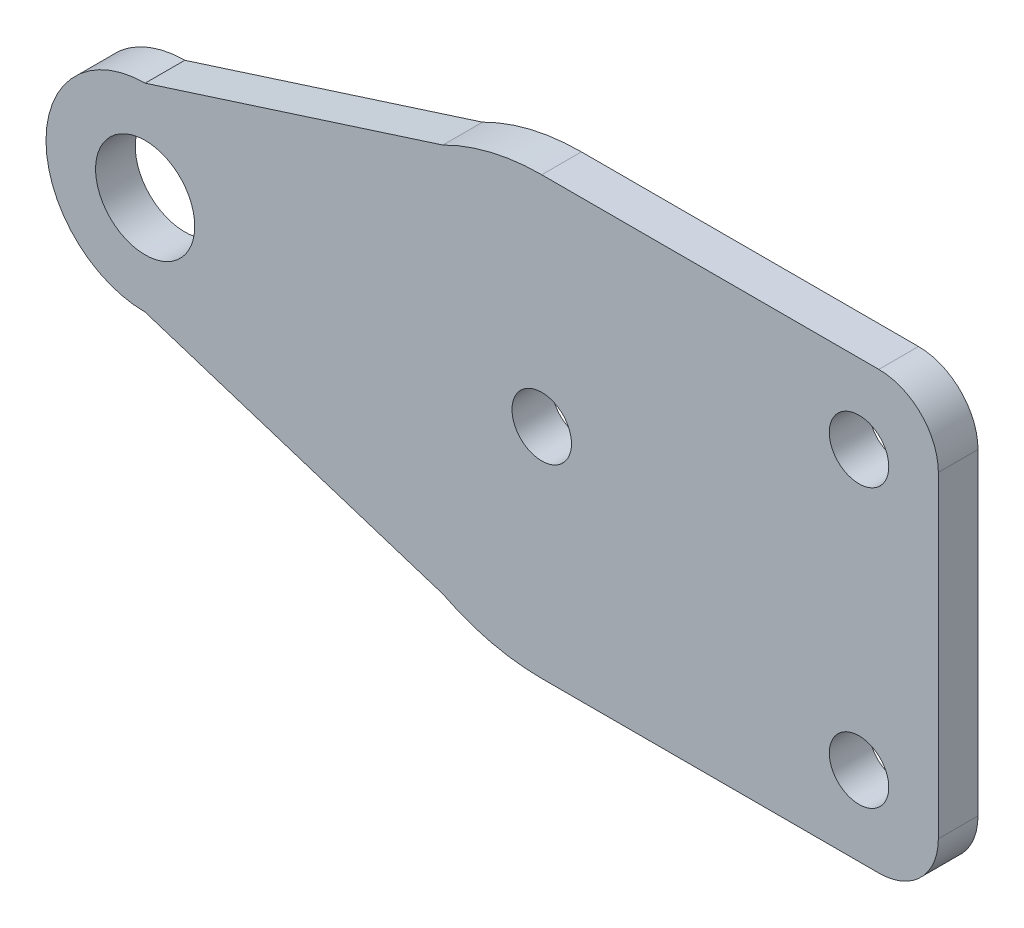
from build123d import *

# Parameters (mm, degrees)
ESQUISSE1_R      = 1.5
ESQUISSE1_R_2    = 2.5
EXTRUSION1_DEPTH = 2


with BuildPart() as part:
    # Esquisse1 → Extrusion1 (new body)
    with BuildSketch(Plane.XY):
        with BuildLine():
            Line((0, 11), (17, 11))
            ThreePointArc((17, 11), (19.121320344, 10.121320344), (20, 8))
            Line((20, 8), (20, -8))
            ThreePointArc((20, -8), (19.121320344, -10.121320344), (17, -11))
            Line((17, -11), (0, -11))
            ThreePointArc((0, -11), (-2.56464411, -10.696850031), (-4.987929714, -9.804109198))
            Line((-4.987929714, -9.804109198), (-20, -5))
            ThreePointArc((-20, -5), (-25, 0), (-20, 5))
            Line((-20, 5), (-4.987929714, 9.804109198))
            ThreePointArc((-4.987929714, 9.804109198), (-2.56464411, 10.696850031), (0, 11))
        make_face()
        with Locations((16, 7)):
            Circle(ESQUISSE1_R, mode=Mode.SUBTRACT)
        Circle(ESQUISSE1_R, mode=Mode.SUBTRACT)
        with Locations(Location((16, -7, 0), (0, 0, 180))):
            Circle(ESQUISSE1_R, mode=Mode.SUBTRACT)
        with Locations((-20, 0)):
            Circle(ESQUISSE1_R_2, mode=Mode.SUBTRACT)
    extrude(amount=EXTRUSION1_DEPTH)


solid = part.part
